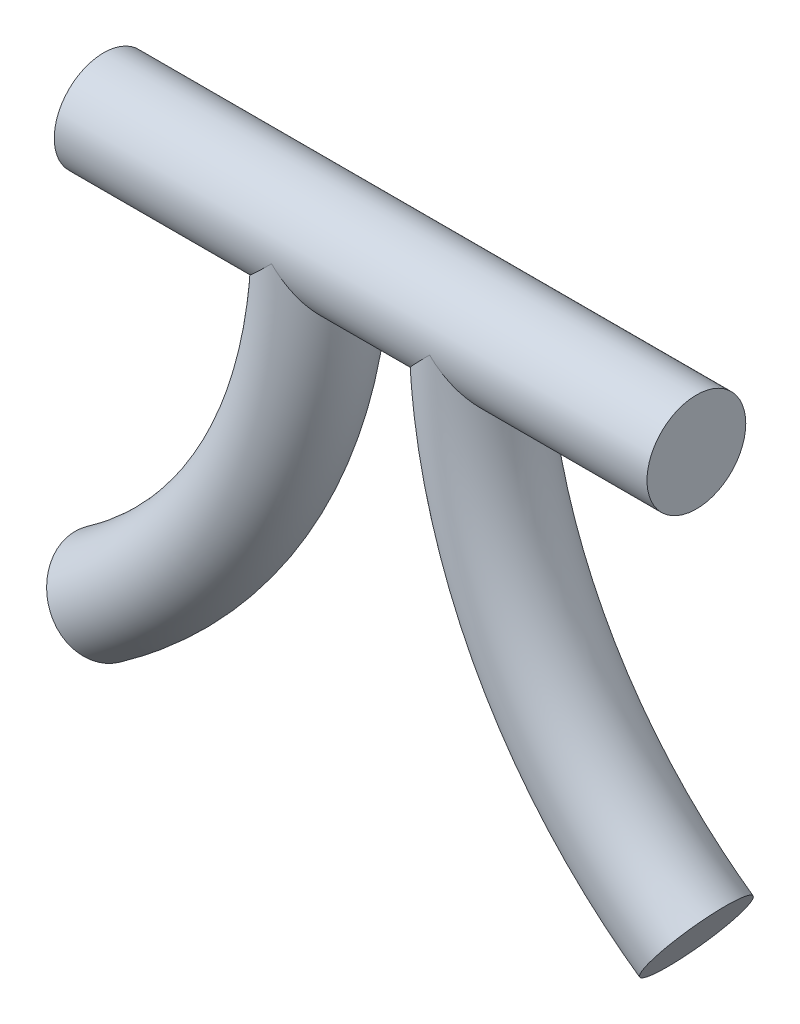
ISO-10303-21;
HEADER;
FILE_DESCRIPTION(('STEP AP214'),'2;1');
FILE_NAME('part.step','',(''),(''),'','','');
FILE_SCHEMA(('AUTOMOTIVE_DESIGN { 1 0 10303 214 1 1 1 1 }'));
ENDSEC;
DATA;
#1=APPLICATION_CONTEXT('core data for automotive mechanical design processes');
#2=APPLICATION_PROTOCOL_DEFINITION('international standard','automotive_design',2000,#1);
#3=PRODUCT_CONTEXT('',#1,'mechanical');
#4=PRODUCT('Part','Part','',(#3));
#5=PRODUCT_RELATED_PRODUCT_CATEGORY('part','',(#4));
#6=PRODUCT_DEFINITION_FORMATION('','',#4);
#7=PRODUCT_DEFINITION_CONTEXT('part definition',#1,'design');
#8=PRODUCT_DEFINITION('design','',#6,#7);
#9=PRODUCT_DEFINITION_SHAPE('','',#8);
#10=(LENGTH_UNIT() NAMED_UNIT(*) SI_UNIT(.MILLI.,.METRE.));
#11=(NAMED_UNIT(*) PLANE_ANGLE_UNIT() SI_UNIT($,.RADIAN.));
#12=(NAMED_UNIT(*) SI_UNIT($,.STERADIAN.) SOLID_ANGLE_UNIT());
#13=UNCERTAINTY_MEASURE_WITH_UNIT(LENGTH_MEASURE(1.E-05),#10,'distance_accuracy_value','');
#14=(GEOMETRIC_REPRESENTATION_CONTEXT(3) GLOBAL_UNCERTAINTY_ASSIGNED_CONTEXT((#13)) GLOBAL_UNIT_ASSIGNED_CONTEXT((#10,
#11,#12)) REPRESENTATION_CONTEXT('',''));
#15=CARTESIAN_POINT('',(0.,0.,0.));
#16=DIRECTION('',(0.,0.,1.));
#17=DIRECTION('',(1.,0.,0.));
#18=AXIS2_PLACEMENT_3D('',#15,#16,#17);
#19=CARTESIAN_POINT('',(-150.,0.,0.));
#20=DIRECTION('',(1.,0.,0.));
#21=DIRECTION('',(0.,0.,-1.));
#22=AXIS2_PLACEMENT_3D('',#19,#20,#21);
#23=CYLINDRICAL_SURFACE('',#22,25.);
#24=CARTESIAN_POINT('',(40.,0.,25.));
#25=CARTESIAN_POINT('',(39.99254646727,-0.00745353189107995,24.9999999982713));
#26=CARTESIAN_POINT('',(39.9850930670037,-0.014907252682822,24.9999966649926));
#27=CARTESIAN_POINT('',(39.0418702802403,-0.958211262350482,24.9991531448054));
#28=CARTESIAN_POINT('',(38.1082167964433,-1.8970099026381,24.9457909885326));
#29=CARTESIAN_POINT('',(36.2514504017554,-3.77391266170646,24.7315744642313));
#30=CARTESIAN_POINT('',(35.328346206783,-4.71201568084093,24.5706369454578));
#31=CARTESIAN_POINT('',(33.4979453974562,-6.58174248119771,24.1371758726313));
#32=CARTESIAN_POINT('',(32.5906825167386,-7.51335037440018,23.8644387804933));
#33=CARTESIAN_POINT('',(30.8019117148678,-9.35925339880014,23.2026966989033));
#34=CARTESIAN_POINT('',(29.920389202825,-10.2735582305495,22.8137590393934));
#35=CARTESIAN_POINT('',(28.4567491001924,-11.7988021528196,22.0516629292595));
#36=CARTESIAN_POINT('',(27.8655935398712,-12.4169190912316,21.7101294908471));
#37=CARTESIAN_POINT('',(26.9943244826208,-13.3307970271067,21.1522383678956));
#38=CARTESIAN_POINT('',(26.7064834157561,-13.6332019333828,20.9586796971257));
#39=CARTESIAN_POINT('',(26.1363638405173,-14.2330959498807,20.5560097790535));
#40=CARTESIAN_POINT('',(25.8540873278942,-14.5305832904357,20.3468930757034));
#41=CARTESIAN_POINT('',(25.0176771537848,-15.4133994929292,19.6967178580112));
#42=CARTESIAN_POINT('',(24.4727537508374,-15.9903512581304,19.2320651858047));
#43=CARTESIAN_POINT('',(23.4131797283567,-17.1153626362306,18.2380790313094));
#44=CARTESIAN_POINT('',(22.8985188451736,-17.6634320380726,17.7087676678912));
#45=CARTESIAN_POINT('',(22.020705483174,-18.6006587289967,16.714303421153));
#46=CARTESIAN_POINT('',(21.6500795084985,-18.9972112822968,16.2627041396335));
#47=CARTESIAN_POINT('',(20.9336319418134,-19.76521058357,15.3201179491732));
#48=CARTESIAN_POINT('',(20.5878089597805,-20.1366587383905,14.8291332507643));
#49=CARTESIAN_POINT('',(19.9249044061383,-20.8499027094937,13.8082860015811));
#50=CARTESIAN_POINT('',(19.6077999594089,-21.1917221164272,13.2784550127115));
#51=CARTESIAN_POINT('',(19.1567058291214,-21.67871773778,12.4553152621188));
#52=CARTESIAN_POINT('',(19.0104395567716,-21.8367556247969,12.1762133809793));
#53=CARTESIAN_POINT('',(18.7265569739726,-22.1437107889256,11.6086257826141));
#54=CARTESIAN_POINT('',(18.5889429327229,-22.2926256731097,11.3201376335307));
#55=CARTESIAN_POINT('',(18.2389872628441,-22.6715792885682,10.5490799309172));
#56=CARTESIAN_POINT('',(18.0343111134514,-22.8934869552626,10.0589544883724));
#57=CARTESIAN_POINT('',(17.6521091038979,-23.308259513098,9.05644828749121));
#58=CARTESIAN_POINT('',(17.4745777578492,-23.5011302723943,8.54407205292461));
#59=CARTESIAN_POINT('',(17.1490900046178,-23.8550207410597,7.4994612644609));
#60=CARTESIAN_POINT('',(17.001123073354,-24.0160517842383,6.96723385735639));
#61=CARTESIAN_POINT('',(16.7369650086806,-24.3037106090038,5.88580322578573));
#62=CARTESIAN_POINT('',(16.6207742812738,-24.4303379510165,5.33659978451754));
#63=CARTESIAN_POINT('',(16.4215635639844,-24.647537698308,4.22175425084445));
#64=CARTESIAN_POINT('',(16.338739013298,-24.737897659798,3.6560355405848));
#65=CARTESIAN_POINT('',(16.2087561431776,-24.8797420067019,2.51566065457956));
#66=CARTESIAN_POINT('',(16.161597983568,-24.9312262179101,1.94100443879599));
#67=CARTESIAN_POINT('',(16.1038695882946,-24.9942538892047,0.787811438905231));
#68=CARTESIAN_POINT('',(16.0932901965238,-25.0058073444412,0.209275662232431));
#69=CARTESIAN_POINT('',(16.1089072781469,-24.9887547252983,-0.946678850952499));
#70=CARTESIAN_POINT('',(16.1351011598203,-24.9601514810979,-1.52409766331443));
#71=CARTESIAN_POINT('',(16.2195563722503,-24.8679589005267,-2.6186471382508));
#72=CARTESIAN_POINT('',(16.2745663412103,-24.8079170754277,-3.13633553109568));
#73=CARTESIAN_POINT('',(16.4134534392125,-24.6563934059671,-4.16311572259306));
#74=CARTESIAN_POINT('',(16.4973283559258,-24.5649139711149,-4.6722081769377));
#75=CARTESIAN_POINT('',(16.6927035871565,-24.3519513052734,-5.67865128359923));
#76=CARTESIAN_POINT('',(16.8042042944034,-24.2304676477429,-6.17600176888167));
#77=CARTESIAN_POINT('',(17.0532958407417,-23.959272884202,-7.15624888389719));
#78=CARTESIAN_POINT('',(17.1908880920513,-23.8095602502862,-7.63914472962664));
#79=CARTESIAN_POINT('',(17.4964862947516,-23.4773288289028,-8.6074097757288));
#80=CARTESIAN_POINT('',(17.66549701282,-23.2937283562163,-9.09208955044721));
#81=CARTESIAN_POINT('',(18.0278044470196,-22.9005505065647,-10.0413523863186));
#82=CARTESIAN_POINT('',(18.2211010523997,-22.6909732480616,-10.5059355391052));
#83=CARTESIAN_POINT('',(18.6299503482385,-22.2481982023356,-11.4137102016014));
#84=CARTESIAN_POINT('',(18.8455097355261,-22.0149933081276,-11.8568952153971));
#85=CARTESIAN_POINT('',(19.2968069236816,-21.527368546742,-12.7207923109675));
#86=CARTESIAN_POINT('',(19.5325488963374,-21.2729442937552,-13.1414997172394));
#87=CARTESIAN_POINT('',(20.140121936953,-20.6181153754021,-14.1567405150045));
#88=CARTESIAN_POINT('',(20.5228546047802,-20.2063751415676,-14.7375088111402));
#89=CARTESIAN_POINT('',(21.3224857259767,-19.3480711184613,-15.8475493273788));
#90=CARTESIAN_POINT('',(21.7393968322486,-18.9014944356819,-16.376802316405));
#91=CARTESIAN_POINT('',(22.6030164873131,-17.9786532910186,-17.3849320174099));
#92=CARTESIAN_POINT('',(23.0497805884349,-17.5023335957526,-17.8637102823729));
#93=CARTESIAN_POINT('',(23.9678805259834,-16.5260001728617,-18.7705974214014));
#94=CARTESIAN_POINT('',(24.4392164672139,-16.0259863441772,-19.1987060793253));
#95=CARTESIAN_POINT('',(25.5716805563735,-14.827845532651,-20.1471073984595));
#96=CARTESIAN_POINT('',(26.2414101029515,-14.1217251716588,-20.6470921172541));
#97=CARTESIAN_POINT('',(27.61104786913,-12.6832148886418,-21.5606700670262));
#98=CARTESIAN_POINT('',(28.3109678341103,-11.9508147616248,-21.9742293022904));
#99=CARTESIAN_POINT('',(29.7346047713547,-10.4670711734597,-22.7184814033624));
#100=CARTESIAN_POINT('',(30.4583280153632,-9.71572273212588,-23.0491522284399));
#101=CARTESIAN_POINT('',(31.9239158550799,-8.20048083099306,-23.6307112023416));
#102=CARTESIAN_POINT('',(32.6657757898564,-7.43659061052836,-23.8816196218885));
#103=CARTESIAN_POINT('',(33.9514826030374,-6.11831743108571,-24.2464937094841));
#104=CARTESIAN_POINT('',(34.4920043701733,-5.56577087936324,-24.3791203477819));
#105=CARTESIAN_POINT('',(35.5786009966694,-4.45842459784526,-24.605729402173));
#106=CARTESIAN_POINT('',(36.1246755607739,-3.90362498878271,-24.6997138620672));
#107=CARTESIAN_POINT('',(37.7676032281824,-2.23968104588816,-24.9245871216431));
#108=CARTESIAN_POINT('',(38.8713242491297,-1.12877207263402,-24.9990005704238));
#109=CARTESIAN_POINT('',(39.9850930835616,-0.0149072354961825,-24.9999966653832));
#110=CARTESIAN_POINT('',(39.9925464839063,-0.00745351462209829,-24.999999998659));
#111=CARTESIAN_POINT('',(40.,0.,-25.));
#112=B_SPLINE_CURVE_WITH_KNOTS('',3,(#24,#25,#26,#27,#28,#29,#30,#31,#32,#33,#34,#35,#36,#37,
#38,#39,#40,#41,#42,#43,#44,#45,#46,#47,#48,#49,#50,#51,#52,#53,#54,#55,#56,#57,#58,#59,#60,#61,
#62,#63,#64,#65,#66,#67,#68,#69,#70,#71,#72,#73,#74,#75,#76,#77,#78,#79,#80,#81,#82,#83,#84,#85,
#86,#87,#88,#89,#90,#91,#92,#93,#94,#95,#96,#97,#98,#99,#100,#101,#102,#103,#104,#105,#106,#107,
#108,#109,#110,#111),.UNSPECIFIED.,.F.,.F.,(4,2,2,2,2,2,2,2,2,2,2,2,2,2,2,2,2,2,2,2,2,2,2,2,2,2,
2,2,2,2,2,2,2,2,2,2,2,2,2,2,2,2,2,4),(0.,0.0316227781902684,4.00191337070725,7.97527636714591,
11.9562641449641,15.9349496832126,18.6955331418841,20.0757798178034,21.4565128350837,
24.212252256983,26.967051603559,29.0835168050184,31.1998633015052,33.314508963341,
34.3717579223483,35.4292830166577,37.1543846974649,38.8791372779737,40.6032747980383,
42.3274343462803,44.0615510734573,45.795675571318,47.529365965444,49.2629341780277,
50.8332858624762,52.4035172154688,53.9737708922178,55.5441095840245,57.1779408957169,
58.8117647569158,60.4460815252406,62.0807369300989,64.5019454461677,66.9240543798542,
69.3508032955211,71.7775625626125,75.0551947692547,78.3341138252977,81.6139038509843,
84.8928596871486,87.2446402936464,89.5962964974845,94.290170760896,94.3217935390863),.UNSPECIFIED.);
#113=CARTESIAN_POINT('',(40.,0.,25.));
#114=VERTEX_POINT('',#113);
#115=CARTESIAN_POINT('',(40.,0.,-25.));
#116=VERTEX_POINT('',#115);
#117=EDGE_CURVE('E12',#114,#116,#112,.T.);
#118=ORIENTED_EDGE('',*,*,#117,.F.);
#119=CARTESIAN_POINT('',(40.,0.,-25.));
#120=CARTESIAN_POINT('',(40.007453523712,-0.00745352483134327,-24.9999999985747));
#121=CARTESIAN_POINT('',(40.0149072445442,-0.0149069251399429,-24.9999966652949));
#122=CARTESIAN_POINT('',(41.0057981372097,-1.00571245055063,-24.9991106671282));
#123=CARTESIAN_POINT('',(41.9926327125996,-1.98686340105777,-24.9402383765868));
#124=CARTESIAN_POINT('',(43.4718415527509,-3.44913078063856,-24.7657994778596));
#125=CARTESIAN_POINT('',(43.9649991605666,-3.93523257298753,-24.693236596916));
#126=CARTESIAN_POINT('',(44.9501303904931,-4.90347434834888,-24.5193355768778));
#127=CARTESIAN_POINT('',(45.4421040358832,-5.38561440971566,-24.4179980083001));
#128=CARTESIAN_POINT('',(46.9173908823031,-6.82723107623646,-24.0700683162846));
#129=CARTESIAN_POINT('',(47.8978269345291,-7.77968698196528,-23.7798215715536));
#130=CARTESIAN_POINT('',(49.3554905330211,-9.18762824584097,-23.2559244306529));
#131=CARTESIAN_POINT('',(49.8391556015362,-9.65342981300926,-23.0665658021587));
#132=CARTESIAN_POINT('',(50.801177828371,-10.577265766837,-22.6578145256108));
#133=CARTESIAN_POINT('',(51.2795353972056,-11.0353007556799,-22.4384242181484));
#134=CARTESIAN_POINT('',(52.4350898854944,-12.1386116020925,-21.8675417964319));
#135=CARTESIAN_POINT('',(53.1088535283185,-12.7792379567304,-21.4999409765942));
#136=CARTESIAN_POINT('',(54.4384025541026,-14.0383533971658,-20.6997840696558));
#137=CARTESIAN_POINT('',(55.0941876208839,-14.6568420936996,-20.2672268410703));
#138=CARTESIAN_POINT('',(56.3809417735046,-15.8657067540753,-19.3354752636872));
#139=CARTESIAN_POINT('',(57.0119590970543,-16.456137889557,-18.8364197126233));
#140=CARTESIAN_POINT('',(58.2435774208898,-17.6042516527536,-17.7680863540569));
#141=CARTESIAN_POINT('',(58.8441892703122,-18.1619459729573,-17.1988338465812));
#142=CARTESIAN_POINT('',(59.8334137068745,-19.0772651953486,-16.1673051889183));
#143=CARTESIAN_POINT('',(60.2319645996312,-19.4450752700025,-15.7235438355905));
#144=CARTESIAN_POINT('',(61.0060109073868,-20.1577361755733,-14.7988631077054));
#145=CARTESIAN_POINT('',(61.3815073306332,-20.5025880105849,-14.3179453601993));
#146=CARTESIAN_POINT('',(62.1045854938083,-21.1651968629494,-13.3189087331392));
#147=CARTESIAN_POINT('',(62.4521982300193,-21.482983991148,-12.8008324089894));
#148=CARTESIAN_POINT('',(63.1148777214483,-22.0875934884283,-11.7268005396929));
#149=CARTESIAN_POINT('',(63.4299412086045,-22.3744127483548,-11.1708412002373));
#150=CARTESIAN_POINT('',(63.9556324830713,-22.8521337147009,-10.1500263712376));
#151=CARTESIAN_POINT('',(64.1738971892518,-23.0501755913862,-9.69243427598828));
#152=CARTESIAN_POINT('',(64.5840035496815,-23.421828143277,-8.75622066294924));
#153=CARTESIAN_POINT('',(64.7758600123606,-23.5954525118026,-8.27761113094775));
#154=CARTESIAN_POINT('',(65.130090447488,-23.9156865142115,-7.30095326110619));
#155=CARTESIAN_POINT('',(65.2924736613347,-24.0623046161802,-6.80291107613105));
#156=CARTESIAN_POINT('',(65.5847519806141,-24.3259863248,-5.78967800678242));
#157=CARTESIAN_POINT('',(65.7146468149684,-24.4430496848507,-5.27448697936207));
#158=CARTESIAN_POINT('',(65.9400820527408,-24.6460916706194,-4.22584038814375));
#159=CARTESIAN_POINT('',(66.0353226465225,-24.7317990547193,-3.69226721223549));
#160=CARTESIAN_POINT('',(66.1875668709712,-24.8687537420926,-2.615280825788));
#161=CARTESIAN_POINT('',(66.2445705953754,-24.9200011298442,-2.07186763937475));
#162=CARTESIAN_POINT('',(66.318823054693,-24.9867479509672,-0.980409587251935));
#163=CARTESIAN_POINT('',(66.3360920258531,-25.0022655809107,-0.432367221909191));
#164=CARTESIAN_POINT('',(66.3304566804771,-24.9972010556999,0.663313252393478));
#165=CARTESIAN_POINT('',(66.3075562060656,-24.9766223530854,1.21095139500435));
#166=CARTESIAN_POINT('',(66.227685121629,-24.9048194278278,2.23093508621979));
#167=CARTESIAN_POINT('',(66.175439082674,-24.8578445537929,2.70396440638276));
#168=CARTESIAN_POINT('',(66.0419352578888,-24.7377469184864,3.64247605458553));
#169=CARTESIAN_POINT('',(65.9606811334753,-24.6646274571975,4.10795932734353));
#170=CARTESIAN_POINT('',(65.7706452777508,-24.4934969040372,5.02871453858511));
#171=CARTESIAN_POINT('',(65.6618560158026,-24.3954790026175,5.48398364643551));
#172=CARTESIAN_POINT('',(65.4186134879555,-24.1761305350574,6.38188113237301));
#173=CARTESIAN_POINT('',(65.2841562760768,-24.0547963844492,6.824507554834));
#174=CARTESIAN_POINT('',(64.9489156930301,-23.751968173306,7.82236359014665));
#175=CARTESIAN_POINT('',(64.7402270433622,-23.5632507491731,8.37276198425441));
#176=CARTESIAN_POINT('',(64.2880078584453,-23.1536689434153,9.44659307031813));
#177=CARTESIAN_POINT('',(64.0444687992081,-22.9327966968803,9.97001912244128));
#178=CARTESIAN_POINT('',(63.5266808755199,-22.4623777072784,10.9889441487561));
#179=CARTESIAN_POINT('',(63.2523906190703,-22.2127923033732,11.4844040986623));
#180=CARTESIAN_POINT('',(62.6775189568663,-21.688697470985,12.4458945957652));
#181=CARTESIAN_POINT('',(62.3769359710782,-21.4141865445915,12.9119233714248));
#182=CARTESIAN_POINT('',(61.6288871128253,-20.7296199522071,13.9942992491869));
#183=CARTESIAN_POINT('',(61.1705983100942,-20.3091216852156,14.5965975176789));
#184=CARTESIAN_POINT('',(60.2183886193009,-19.432703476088,15.7445846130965));
#185=CARTESIAN_POINT('',(59.7244540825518,-18.9767699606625,16.2902515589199));
#186=CARTESIAN_POINT('',(58.7071926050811,-18.0346926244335,17.3274764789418));
#187=CARTESIAN_POINT('',(58.1838187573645,-17.5485004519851,17.8189441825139));
#188=CARTESIAN_POINT('',(57.1141594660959,-16.5514515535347,18.7487091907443));
#189=CARTESIAN_POINT('',(56.5678742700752,-16.0405950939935,19.1870070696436));
#190=CARTESIAN_POINT('',(55.2280298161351,-14.7832630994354,20.1825872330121));
#191=CARTESIAN_POINT('',(54.4253019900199,-14.0264087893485,20.7145168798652));
#192=CARTESIAN_POINT('',(52.7933035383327,-12.4798385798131,21.681459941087));
#193=CARTESIAN_POINT('',(51.9640208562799,-11.6901077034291,22.1164285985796));
#194=CARTESIAN_POINT('',(50.287242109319,-10.0850795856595,22.8929173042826));
#195=CARTESIAN_POINT('',(49.4397499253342,-9.26978777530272,23.2344570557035));
#196=CARTESIAN_POINT('',(47.7330405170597,-7.61944042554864,23.8267155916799));
#197=CARTESIAN_POINT('',(46.8738278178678,-6.78439242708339,24.0774684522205));
#198=CARTESIAN_POINT('',(45.5138674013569,-5.45587739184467,24.4025338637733));
#199=CARTESIAN_POINT('',(45.0152309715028,-4.96733977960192,24.5066133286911));
#200=CARTESIAN_POINT('',(44.0167038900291,-3.98615676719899,24.6852040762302));
#201=CARTESIAN_POINT('',(43.5168131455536,-3.49351105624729,24.7597131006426));
#202=CARTESIAN_POINT('',(42.0181347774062,-2.0122169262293,24.9387076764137));
#203=CARTESIAN_POINT('',(41.0184981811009,-1.01841139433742,24.999099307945));
#204=CARTESIAN_POINT('',(40.0149072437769,-0.0149069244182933,24.999996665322));
#205=CARTESIAN_POINT('',(40.0074535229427,-0.00745352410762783,24.9999999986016));
#206=CARTESIAN_POINT('',(40.,0.,25.));
#207=B_SPLINE_CURVE_WITH_KNOTS('',3,(#119,#120,#121,#122,#123,#124,#125,#126,#127,#128,#129,
#130,#131,#132,#133,#134,#135,#136,#137,#138,#139,#140,#141,#142,#143,#144,#145,#146,#147,#148,
#149,#150,#151,#152,#153,#154,#155,#156,#157,#158,#159,#160,#161,#162,#163,#164,#165,#166,#167,
#168,#169,#170,#171,#172,#173,#174,#175,#176,#177,#178,#179,#180,#181,#182,#183,#184,#185,#186,
#187,#188,#189,#190,#191,#192,#193,#194,#195,#196,#197,#198,#199,#200,#201,#202,#203,#204,#205,
#206),.UNSPECIFIED.,.F.,.F.,(4,2,2,2,2,2,2,2,2,2,2,2,2,2,2,2,2,2,2,2,2,2,2,2,2,2,2,2,2,2,2,2,2,
2,2,2,2,2,2,2,2,2,2,4),(0.,0.0316227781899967,4.2037933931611,6.29209972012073,8.38036464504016,
12.566360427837,14.6588521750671,16.7511809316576,19.7479697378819,22.7448112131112,
25.7354927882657,28.7250996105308,30.8258423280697,32.9264931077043,35.0247754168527,
37.1232681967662,38.7547048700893,40.3852229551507,42.0152289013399,43.6452484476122,
45.2890523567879,46.9328522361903,48.5758147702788,50.2186201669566,51.6516240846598,
53.0844471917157,54.517662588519,55.9510984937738,57.8028150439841,59.654985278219,
61.5096792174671,63.3644846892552,65.9579623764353,68.5524384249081,71.1511723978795,
73.7498783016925,77.4189910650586,81.0897939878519,84.7598221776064,88.4284714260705,
90.5452431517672,92.6621764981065,96.8882258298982,96.9198486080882),.UNSPECIFIED.);
#208=EDGE_CURVE('E71',#116,#114,#207,.T.);
#209=ORIENTED_EDGE('',*,*,#208,.F.);
#210=EDGE_LOOP('',(#118,#209));
#211=FACE_BOUND('',#210,.T.);
#212=CARTESIAN_POINT('',(-40.,0.,25.));
#213=CARTESIAN_POINT('',(-40.0074535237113,-0.00745352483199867,24.9999999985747));
#214=CARTESIAN_POINT('',(-40.0149072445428,-0.0149069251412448,24.9999966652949));
#215=CARTESIAN_POINT('',(-41.0057981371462,-1.00571245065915,24.999110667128));
#216=CARTESIAN_POINT('',(-41.992632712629,-1.9868634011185,24.940238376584));
#217=CARTESIAN_POINT('',(-43.4718415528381,-3.44913078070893,24.7657994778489));
#218=CARTESIAN_POINT('',(-43.9649991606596,-3.93523257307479,24.6932365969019));
#219=CARTESIAN_POINT('',(-44.9501303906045,-4.90347434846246,24.5193355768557));
#220=CARTESIAN_POINT('',(-45.4421040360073,-5.38561440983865,24.4179980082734));
#221=CARTESIAN_POINT('',(-46.9173908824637,-6.82723107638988,24.0700683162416));
#222=CARTESIAN_POINT('',(-47.8978269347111,-7.77968698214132,23.779821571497));
#223=CARTESIAN_POINT('',(-49.3554905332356,-9.18762824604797,23.2559244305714));
#224=CARTESIAN_POINT('',(-49.8391556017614,-9.65342981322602,23.0665658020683));
#225=CARTESIAN_POINT('',(-50.8011778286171,-10.5772657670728,22.6578145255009));
#226=CARTESIAN_POINT('',(-51.2795353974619,-11.0353007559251,22.4384242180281));
#227=CARTESIAN_POINT('',(-52.4350898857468,-12.1386116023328,21.8675417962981));
#228=CARTESIAN_POINT('',(-53.108853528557,-12.7792379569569,21.4999409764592));
#229=CARTESIAN_POINT('',(-54.4384025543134,-14.0383533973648,20.6997840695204));
#230=CARTESIAN_POINT('',(-55.0941876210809,-14.6568420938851,20.2672268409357));
#231=CARTESIAN_POINT('',(-56.3809417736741,-15.8657067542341,19.3354752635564));
#232=CARTESIAN_POINT('',(-57.0119590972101,-16.4561378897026,18.8364197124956));
#233=CARTESIAN_POINT('',(-58.2435774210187,-17.6042516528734,17.7680863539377));
#234=CARTESIAN_POINT('',(-58.8441892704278,-18.1619459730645,17.1988338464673));
#235=CARTESIAN_POINT('',(-59.8334137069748,-19.0772651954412,16.167305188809));
#236=CARTESIAN_POINT('',(-60.2319645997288,-19.4450752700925,15.7235438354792));
#237=CARTESIAN_POINT('',(-61.0060109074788,-20.1577361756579,14.7988631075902));
#238=CARTESIAN_POINT('',(-61.3815073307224,-20.5025880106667,14.3179453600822));
#239=CARTESIAN_POINT('',(-62.1045854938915,-21.1651968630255,13.3189087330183));
#240=CARTESIAN_POINT('',(-62.4521982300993,-21.4829839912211,12.8008324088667));
#241=CARTESIAN_POINT('',(-63.1148777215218,-22.0875934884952,11.7268005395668));
#242=CARTESIAN_POINT('',(-63.4299412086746,-22.3744127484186,11.1708412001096));
#243=CARTESIAN_POINT('',(-63.9556324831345,-22.8521337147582,10.1500263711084));
#244=CARTESIAN_POINT('',(-64.1738971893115,-23.0501755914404,9.69243427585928));
#245=CARTESIAN_POINT('',(-64.5840035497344,-23.4218281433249,8.75622066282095));
#246=CARTESIAN_POINT('',(-64.7758600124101,-23.5954525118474,8.27761113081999));
#247=CARTESIAN_POINT('',(-65.1300904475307,-23.9156865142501,7.30095326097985));
#248=CARTESIAN_POINT('',(-65.292473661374,-24.0623046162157,6.80291107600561));
#249=CARTESIAN_POINT('',(-65.5847519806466,-24.3259863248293,5.78967800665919));
#250=CARTESIAN_POINT('',(-65.7146468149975,-24.4430496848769,5.27448697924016));
#251=CARTESIAN_POINT('',(-65.9400820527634,-24.6460916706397,4.225840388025));
#252=CARTESIAN_POINT('',(-66.0353226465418,-24.7317990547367,3.6922672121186));
#253=CARTESIAN_POINT('',(-66.1875668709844,-24.8687537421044,2.61528082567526));
#254=CARTESIAN_POINT('',(-66.2445705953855,-24.9200011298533,2.0718676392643));
#255=CARTESIAN_POINT('',(-66.3188230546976,-24.9867479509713,0.980409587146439));
#256=CARTESIAN_POINT('',(-66.3360920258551,-25.0022655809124,0.432367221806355));
#257=CARTESIAN_POINT('',(-66.3304566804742,-24.9972010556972,-0.663313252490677));
#258=CARTESIAN_POINT('',(-66.3075562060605,-24.9766223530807,-1.21095139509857));
#259=CARTESIAN_POINT('',(-66.22768512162,-24.9048194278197,-2.23093508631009));
#260=CARTESIAN_POINT('',(-66.1754390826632,-24.8578445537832,-2.7039644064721));
#261=CARTESIAN_POINT('',(-66.0419352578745,-24.7377469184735,-3.64247605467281));
#262=CARTESIAN_POINT('',(-65.9606811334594,-24.6646274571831,-4.10795932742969));
#263=CARTESIAN_POINT('',(-65.7706452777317,-24.4934969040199,-5.02871453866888));
#264=CARTESIAN_POINT('',(-65.661856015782,-24.3954790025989,-5.48398364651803));
#265=CARTESIAN_POINT('',(-65.4186134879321,-24.1761305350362,-6.38188113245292));
#266=CARTESIAN_POINT('',(-65.2841562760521,-24.0547963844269,-6.82450755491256));
#267=CARTESIAN_POINT('',(-64.9489156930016,-23.7519681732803,-7.82236359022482));
#268=CARTESIAN_POINT('',(-64.7402270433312,-23.5632507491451,-8.37276198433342));
#269=CARTESIAN_POINT('',(-64.2880078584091,-23.1536689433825,-9.44659307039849));
#270=CARTESIAN_POINT('',(-64.0444687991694,-22.9327966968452,-9.97001912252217));
#271=CARTESIAN_POINT('',(-63.526680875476,-22.4623777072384,-10.9889441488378));
#272=CARTESIAN_POINT('',(-63.2523906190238,-22.2127923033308,-11.4844040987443));
#273=CARTESIAN_POINT('',(-62.6775189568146,-21.6886974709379,-12.4458945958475));
#274=CARTESIAN_POINT('',(-62.376935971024,-21.4141865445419,-12.9119233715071));
#275=CARTESIAN_POINT('',(-61.6288871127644,-20.7296199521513,-13.9942992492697));
#276=CARTESIAN_POINT('',(-61.1705983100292,-20.309121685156,-14.596597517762));
#277=CARTESIAN_POINT('',(-60.2183886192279,-19.4327034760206,-15.7445846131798));
#278=CARTESIAN_POINT('',(-59.7244540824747,-18.9767699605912,-16.290251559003));
#279=CARTESIAN_POINT('',(-58.707192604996,-18.0346926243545,-17.3274764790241));
#280=CARTESIAN_POINT('',(-58.1838187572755,-17.5485004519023,-17.8189441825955));
#281=CARTESIAN_POINT('',(-57.1141594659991,-16.5514515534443,-18.7487091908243));
#282=CARTESIAN_POINT('',(-56.5678742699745,-16.0405950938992,-19.1870070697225));
#283=CARTESIAN_POINT('',(-55.2280298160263,-14.7832630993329,-20.1825872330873));
#284=CARTESIAN_POINT('',(-54.4253019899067,-14.0264087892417,-20.7145168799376));
#285=CARTESIAN_POINT('',(-52.7933035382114,-12.4798385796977,-21.6814599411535));
#286=CARTESIAN_POINT('',(-51.9640208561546,-11.6901077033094,-22.1164285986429));
#287=CARTESIAN_POINT('',(-50.2872421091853,-10.0850795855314,-22.8929173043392));
#288=CARTESIAN_POINT('',(-49.4397499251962,-9.26978777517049,-23.2344570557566));
#289=CARTESIAN_POINT('',(-47.7330405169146,-7.61944042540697,-23.8267155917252));
#290=CARTESIAN_POINT('',(-46.87382781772,-6.7843924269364,-24.0774684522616));
#291=CARTESIAN_POINT('',(-45.5138674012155,-5.45587739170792,-24.4025338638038));
#292=CARTESIAN_POINT('',(-45.0152309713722,-4.96733977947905,-24.5066133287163));
#293=CARTESIAN_POINT('',(-44.016703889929,-3.98615676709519,-24.6852040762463));
#294=CARTESIAN_POINT('',(-43.5168131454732,-3.49351105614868,-24.7597131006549));
#295=CARTESIAN_POINT('',(-42.0181347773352,-2.01221692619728,-24.9387076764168));
#296=CARTESIAN_POINT('',(-41.0184981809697,-1.01841139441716,-24.9990993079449));
#297=CARTESIAN_POINT('',(-40.0149072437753,-0.0149069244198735,-24.999996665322));
#298=CARTESIAN_POINT('',(-40.0074535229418,-0.00745352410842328,-24.9999999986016));
#299=CARTESIAN_POINT('',(-40.,0.,-25.));
#300=B_SPLINE_CURVE_WITH_KNOTS('',3,(#212,#213,#214,#215,#216,#217,#218,#219,#220,#221,#222,
#223,#224,#225,#226,#227,#228,#229,#230,#231,#232,#233,#234,#235,#236,#237,#238,#239,#240,#241,
#242,#243,#244,#245,#246,#247,#248,#249,#250,#251,#252,#253,#254,#255,#256,#257,#258,#259,#260,
#261,#262,#263,#264,#265,#266,#267,#268,#269,#270,#271,#272,#273,#274,#275,#276,#277,#278,#279,
#280,#281,#282,#283,#284,#285,#286,#287,#288,#289,#290,#291,#292,#293,#294,#295,#296,#297,#298,
#299),.UNSPECIFIED.,.F.,.F.,(4,2,2,2,2,2,2,2,2,2,2,2,2,2,2,2,2,2,2,2,2,2,2,2,2,2,2,2,2,2,2,2,2,
2,2,2,2,2,2,2,2,2,2,4),(0.,0.0316227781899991,4.20379339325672,6.29209972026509,
8.38036464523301,12.5663604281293,14.6588521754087,16.7511809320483,19.7479697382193,
22.7448112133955,25.735492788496,28.7250996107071,30.8258423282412,32.926493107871,
35.0247754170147,37.1232681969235,38.7547048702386,40.3852229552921,42.0152289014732,
43.6452484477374,45.2890523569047,46.9328522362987,48.5758147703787,50.2186201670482,
51.6516240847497,53.0844471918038,54.5176625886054,55.9510984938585,57.8028150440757,
59.6549852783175,61.5096792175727,63.3644846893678,65.9579623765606,68.5524384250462,
71.1511723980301,73.7498783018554,77.4189910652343,81.0897939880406,84.7598221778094,
88.4284714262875,90.5452431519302,92.6621764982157,96.8882258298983,96.9198486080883),.UNSPECIFIED.);
#301=CARTESIAN_POINT('',(-40.,0.,25.));
#302=VERTEX_POINT('',#301);
#303=CARTESIAN_POINT('',(-40.,0.,-25.));
#304=VERTEX_POINT('',#303);
#305=EDGE_CURVE('E90',#302,#304,#300,.T.);
#306=ORIENTED_EDGE('',*,*,#305,.F.);
#307=CARTESIAN_POINT('',(-40.,0.,-25.));
#308=CARTESIAN_POINT('',(-39.9925464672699,-0.00745353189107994,-24.9999999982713));
#309=CARTESIAN_POINT('',(-39.9850930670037,-0.014907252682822,-24.9999966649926));
#310=CARTESIAN_POINT('',(-39.0418702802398,-0.958211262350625,-24.9991531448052));
#311=CARTESIAN_POINT('',(-38.1082167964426,-1.89700990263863,-24.9457909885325));
#312=CARTESIAN_POINT('',(-36.2514504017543,-3.77391266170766,-24.7315744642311));
#313=CARTESIAN_POINT('',(-35.3283462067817,-4.7120156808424,-24.5706369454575));
#314=CARTESIAN_POINT('',(-33.4979453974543,-6.58174248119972,-24.1371758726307));
#315=CARTESIAN_POINT('',(-32.5906825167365,-7.51335037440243,-23.8644387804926));
#316=CARTESIAN_POINT('',(-30.8019117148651,-9.35925339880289,-23.2026966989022));
#317=CARTESIAN_POINT('',(-29.9203892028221,-10.2735582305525,-22.8137590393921));
#318=CARTESIAN_POINT('',(-28.4567491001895,-11.7988021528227,-22.0516629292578));
#319=CARTESIAN_POINT('',(-27.8655935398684,-12.4169190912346,-21.7101294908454));
#320=CARTESIAN_POINT('',(-26.9943244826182,-13.3307970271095,-21.1522383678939));
#321=CARTESIAN_POINT('',(-26.7064834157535,-13.6332019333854,-20.958679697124));
#322=CARTESIAN_POINT('',(-26.1363638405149,-14.2330959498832,-20.5560097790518));
#323=CARTESIAN_POINT('',(-25.8540873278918,-14.5305832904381,-20.3468930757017));
#324=CARTESIAN_POINT('',(-25.0176771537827,-15.4133994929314,-19.6967178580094));
#325=CARTESIAN_POINT('',(-24.4727537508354,-15.9903512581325,-19.2320651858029));
#326=CARTESIAN_POINT('',(-23.413179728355,-17.1153626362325,-18.2380790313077));
#327=CARTESIAN_POINT('',(-22.898518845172,-17.6634320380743,-17.7087676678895));
#328=CARTESIAN_POINT('',(-22.0207054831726,-18.6006587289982,-16.7143034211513));
#329=CARTESIAN_POINT('',(-21.6500795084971,-18.9972112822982,-16.2627041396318));
#330=CARTESIAN_POINT('',(-20.9336319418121,-19.7652105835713,-15.3201179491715));
#331=CARTESIAN_POINT('',(-20.5878089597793,-20.1366587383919,-14.8291332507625));
#332=CARTESIAN_POINT('',(-19.9249044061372,-20.8499027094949,-13.8082860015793));
#333=CARTESIAN_POINT('',(-19.6077999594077,-21.1917221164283,-13.2784550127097));
#334=CARTESIAN_POINT('',(-19.1567058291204,-21.678717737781,-12.455315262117));
#335=CARTESIAN_POINT('',(-19.0104395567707,-21.836755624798,-12.1762133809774));
#336=CARTESIAN_POINT('',(-18.7265569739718,-22.1437107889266,-11.6086257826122));
#337=CARTESIAN_POINT('',(-18.588942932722,-22.2926256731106,-11.3201376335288));
#338=CARTESIAN_POINT('',(-18.2389872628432,-22.6715792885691,-10.5490799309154));
#339=CARTESIAN_POINT('',(-18.0343111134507,-22.8934869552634,-10.0589544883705));
#340=CARTESIAN_POINT('',(-17.6521091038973,-23.3082595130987,-9.05644828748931));
#341=CARTESIAN_POINT('',(-17.4745777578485,-23.501130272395,-8.54407205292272));
#342=CARTESIAN_POINT('',(-17.1490900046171,-23.8550207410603,-7.49946126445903));
#343=CARTESIAN_POINT('',(-17.0011230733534,-24.0160517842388,-6.96723385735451));
#344=CARTESIAN_POINT('',(-16.7369650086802,-24.3037106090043,-5.88580322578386));
#345=CARTESIAN_POINT('',(-16.6207742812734,-24.4303379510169,-5.33659978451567));
#346=CARTESIAN_POINT('',(-16.4215635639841,-24.6475376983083,-4.2217542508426));
#347=CARTESIAN_POINT('',(-16.3387390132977,-24.7378976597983,-3.65603554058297));
#348=CARTESIAN_POINT('',(-16.2087561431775,-24.8797420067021,-2.51566065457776));
#349=CARTESIAN_POINT('',(-16.1615979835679,-24.9312262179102,-1.94100443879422));
#350=CARTESIAN_POINT('',(-16.1038695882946,-24.9942538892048,-0.787811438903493));
#351=CARTESIAN_POINT('',(-16.0932901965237,-25.0058073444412,-0.20927566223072));
#352=CARTESIAN_POINT('',(-16.1089072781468,-24.9887547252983,0.946678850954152));
#353=CARTESIAN_POINT('',(-16.1351011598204,-24.9601514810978,1.52409766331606));
#354=CARTESIAN_POINT('',(-16.2195563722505,-24.8679589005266,2.61864713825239));
#355=CARTESIAN_POINT('',(-16.2745663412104,-24.8079170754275,3.13633553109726));
#356=CARTESIAN_POINT('',(-16.4134534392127,-24.6563934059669,4.1631157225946));
#357=CARTESIAN_POINT('',(-16.4973283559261,-24.5649139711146,4.67220817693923));
#358=CARTESIAN_POINT('',(-16.6927035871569,-24.3519513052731,5.67865128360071));
#359=CARTESIAN_POINT('',(-16.8042042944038,-24.2304676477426,6.17600176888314));
#360=CARTESIAN_POINT('',(-17.053295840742,-23.9592728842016,7.15624888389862));
#361=CARTESIAN_POINT('',(-17.1908880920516,-23.8095602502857,7.63914472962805));
#362=CARTESIAN_POINT('',(-17.496486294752,-23.4773288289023,8.60740977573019));
#363=CARTESIAN_POINT('',(-17.6654970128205,-23.2937283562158,9.09208955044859));
#364=CARTESIAN_POINT('',(-18.0278044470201,-22.9005505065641,10.0413523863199));
#365=CARTESIAN_POINT('',(-18.2211010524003,-22.690973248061,10.5059355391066));
#366=CARTESIAN_POINT('',(-18.6299503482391,-22.2481982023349,11.4137102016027));
#367=CARTESIAN_POINT('',(-18.8455097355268,-22.0149933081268,11.8568952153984));
#368=CARTESIAN_POINT('',(-19.2968069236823,-21.5273685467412,12.7207923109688));
#369=CARTESIAN_POINT('',(-19.5325488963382,-21.2729442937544,13.1414997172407));
#370=CARTESIAN_POINT('',(-20.1401219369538,-20.6181153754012,14.1567405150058));
#371=CARTESIAN_POINT('',(-20.5228546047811,-20.2063751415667,14.7375088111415));
#372=CARTESIAN_POINT('',(-21.3224857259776,-19.3480711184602,15.8475493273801));
#373=CARTESIAN_POINT('',(-21.7393968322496,-18.9014944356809,16.3768023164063));
#374=CARTESIAN_POINT('',(-22.6030164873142,-17.9786532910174,17.3849320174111));
#375=CARTESIAN_POINT('',(-23.049780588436,-17.5023335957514,17.8637102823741));
#376=CARTESIAN_POINT('',(-23.9678805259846,-16.5260001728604,18.7705974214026));
#377=CARTESIAN_POINT('',(-24.4392164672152,-16.0259863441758,19.1987060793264));
#378=CARTESIAN_POINT('',(-25.5716805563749,-14.8278455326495,20.1471073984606));
#379=CARTESIAN_POINT('',(-26.2414101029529,-14.1217251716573,20.6470921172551));
#380=CARTESIAN_POINT('',(-27.6110478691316,-12.6832148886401,21.5606700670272));
#381=CARTESIAN_POINT('',(-28.310967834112,-11.950814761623,21.9742293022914));
#382=CARTESIAN_POINT('',(-29.7346047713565,-10.4670711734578,22.7184814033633));
#383=CARTESIAN_POINT('',(-30.4583280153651,-9.71572273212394,23.0491522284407));
#384=CARTESIAN_POINT('',(-31.9239158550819,-8.20048083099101,23.6307112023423));
#385=CARTESIAN_POINT('',(-32.6657757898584,-7.43659061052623,23.8816196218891));
#386=CARTESIAN_POINT('',(-33.9514826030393,-6.11831743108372,24.2464937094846));
#387=CARTESIAN_POINT('',(-34.4920043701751,-5.56577087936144,24.3791203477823));
#388=CARTESIAN_POINT('',(-35.5786009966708,-4.4584245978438,24.6057294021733));
#389=CARTESIAN_POINT('',(-36.1246755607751,-3.90362498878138,24.6997138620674));
#390=CARTESIAN_POINT('',(-37.7676032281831,-2.23968104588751,24.9245871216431));
#391=CARTESIAN_POINT('',(-38.8713242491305,-1.12877207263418,24.9990005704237));
#392=CARTESIAN_POINT('',(-39.9850930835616,-0.0149072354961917,24.9999966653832));
#393=CARTESIAN_POINT('',(-39.9925464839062,-0.00745351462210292,24.999999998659));
#394=CARTESIAN_POINT('',(-40.,0.,25.));
#395=B_SPLINE_CURVE_WITH_KNOTS('',3,(#307,#308,#309,#310,#311,#312,#313,#314,#315,#316,#317,
#318,#319,#320,#321,#322,#323,#324,#325,#326,#327,#328,#329,#330,#331,#332,#333,#334,#335,#336,
#337,#338,#339,#340,#341,#342,#343,#344,#345,#346,#347,#348,#349,#350,#351,#352,#353,#354,#355,
#356,#357,#358,#359,#360,#361,#362,#363,#364,#365,#366,#367,#368,#369,#370,#371,#372,#373,#374,
#375,#376,#377,#378,#379,#380,#381,#382,#383,#384,#385,#386,#387,#388,#389,#390,#391,#392,#393,
#394),.UNSPECIFIED.,.F.,.F.,(4,2,2,2,2,2,2,2,2,2,2,2,2,2,2,2,2,2,2,2,2,2,2,2,2,2,2,2,2,2,2,2,2,
2,2,2,2,2,2,2,2,2,2,4),(0.,0.0316227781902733,4.00191337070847,7.97527636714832,
11.9562641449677,15.9349496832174,18.6955331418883,20.0757798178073,21.4565128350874,
24.2122522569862,26.9670516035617,29.083516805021,31.1998633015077,33.3145089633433,
34.3717579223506,35.4292830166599,37.154384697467,38.8791372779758,40.6032747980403,
42.3274343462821,44.0615510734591,45.7956755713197,47.5293659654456,49.2629341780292,
50.8332858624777,52.4035172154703,53.9737708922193,55.544109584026,57.1779408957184,
58.8117647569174,60.4460815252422,62.0807369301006,64.5019454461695,66.9240543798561,
69.3508032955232,71.7775625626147,75.0551947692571,78.3341138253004,81.6139038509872,
84.8928596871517,87.2446402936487,89.596296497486,94.290170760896,94.3217935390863),.UNSPECIFIED.);
#396=EDGE_CURVE('E82',#304,#302,#395,.T.);
#397=ORIENTED_EDGE('',*,*,#396,.F.);
#398=EDGE_LOOP('',(#306,#397));
#399=FACE_BOUND('',#398,.T.);
#400=CARTESIAN_POINT('',(-150.,0.,0.));
#401=DIRECTION('',(1.,0.,0.));
#402=DIRECTION('',(0.,0.,-1.));
#403=AXIS2_PLACEMENT_3D('',#400,#401,#402);
#404=CIRCLE('',#403,25.);
#405=CARTESIAN_POINT('',(-150.,0.,-25.));
#406=VERTEX_POINT('',#405);
#407=EDGE_CURVE('E126',#406,#406,#404,.T.);
#408=ORIENTED_EDGE('',*,*,#407,.T.);
#409=EDGE_LOOP('',(#408));
#410=FACE_BOUND('',#409,.T.);
#411=CARTESIAN_POINT('',(150.,0.,0.));
#412=DIRECTION('',(1.,0.,0.));
#413=DIRECTION('',(0.,0.,-1.));
#414=AXIS2_PLACEMENT_3D('',#411,#412,#413);
#415=CIRCLE('',#414,25.);
#416=CARTESIAN_POINT('',(150.,0.,-25.));
#417=VERTEX_POINT('',#416);
#418=EDGE_CURVE('E127',#417,#417,#415,.T.);
#419=ORIENTED_EDGE('',*,*,#418,.F.);
#420=EDGE_LOOP('',(#419));
#421=FACE_BOUND('',#420,.T.);
#422=ADVANCED_FACE('F57',(#211,#399,#410,#421),#23,.T.);
#423=CARTESIAN_POINT('',(-150.,0.,0.));
#424=DIRECTION('',(1.,0.,0.));
#425=DIRECTION('',(0.,0.,-1.));
#426=AXIS2_PLACEMENT_3D('',#423,#424,#425);
#427=PLANE('',#426);
#428=ORIENTED_EDGE('',*,*,#407,.F.);
#429=EDGE_LOOP('',(#428));
#430=FACE_BOUND('',#429,.T.);
#431=ADVANCED_FACE('F147',(#430),#427,.F.);
#432=CARTESIAN_POINT('',(150.,0.,0.));
#433=DIRECTION('',(1.,0.,0.));
#434=DIRECTION('',(0.,0.,-1.));
#435=AXIS2_PLACEMENT_3D('',#432,#433,#434);
#436=PLANE('',#435);
#437=ORIENTED_EDGE('',*,*,#418,.T.);
#438=EDGE_LOOP('',(#437));
#439=FACE_BOUND('',#438,.T.);
#440=ADVANCED_FACE('F117',(#439),#436,.T.);
#441=CARTESIAN_POINT('',(-150.,-212.367605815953,0.));
#442=DIRECTION('',(-0.816798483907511,-0.576923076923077,0.));
#443=DIRECTION('',(0.576923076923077,-0.816798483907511,0.));
#444=AXIS2_PLACEMENT_3D('',#441,#442,#443);
#445=PLANE('',#444);
#446=CARTESIAN_POINT('',(-150.,-212.367605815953,0.));
#447=DIRECTION('',(-0.816798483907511,-0.576923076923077,0.));
#448=DIRECTION('',(0.576923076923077,-0.816798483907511,0.));
#449=AXIS2_PLACEMENT_3D('',#446,#447,#448);
#450=CIRCLE('',#449,25.);
#451=CARTESIAN_POINT('',(-135.576923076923,-232.787567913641,0.));
#452=VERTEX_POINT('',#451);
#453=EDGE_CURVE('E131',#452,#452,#450,.T.);
#454=ORIENTED_EDGE('',*,*,#453,.T.);
#455=EDGE_LOOP('',(#454));
#456=FACE_BOUND('',#455,.T.);
#457=ADVANCED_FACE('F108',(#456),#445,.T.);
#458=CARTESIAN_POINT('',(-300.,0.,0.));
#459=DIRECTION('',(0.,0.,-1.));
#460=DIRECTION('',(-1.,0.,0.));
#461=AXIS2_PLACEMENT_3D('',#458,#459,#460);
#462=TOROIDAL_SURFACE('',#461,260.,25.);
#463=ORIENTED_EDGE('',*,*,#453,.F.);
#464=EDGE_LOOP('',(#463));
#465=FACE_BOUND('',#464,.T.);
#466=ORIENTED_EDGE('',*,*,#396,.T.);
#467=ORIENTED_EDGE('',*,*,#305,.T.);
#468=EDGE_LOOP('',(#466,#467));
#469=FACE_BOUND('',#468,.T.);
#470=ADVANCED_FACE('F111',(#465,#469),#462,.T.);
#471=CARTESIAN_POINT('',(150.,-212.367605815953,0.));
#472=DIRECTION('',(0.816798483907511,-0.576923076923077,0.));
#473=DIRECTION('',(-0.576923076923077,-0.816798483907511,0.));
#474=AXIS2_PLACEMENT_3D('',#471,#472,#473);
#475=PLANE('',#474);
#476=CARTESIAN_POINT('',(150.,-212.367605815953,0.));
#477=DIRECTION('',(-0.816798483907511,0.576923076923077,0.));
#478=DIRECTION('',(-0.576923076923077,-0.816798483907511,0.));
#479=AXIS2_PLACEMENT_3D('',#476,#477,#478);
#480=CIRCLE('',#479,25.);
#481=CARTESIAN_POINT('',(135.576923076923,-232.787567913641,0.));
#482=VERTEX_POINT('',#481);
#483=EDGE_CURVE('E138',#482,#482,#480,.F.);
#484=ORIENTED_EDGE('',*,*,#483,.T.);
#485=EDGE_LOOP('',(#484));
#486=FACE_BOUND('',#485,.T.);
#487=ADVANCED_FACE('F106',(#486),#475,.T.);
#488=CARTESIAN_POINT('',(300.,0.,0.));
#489=DIRECTION('',(0.,0.,1.));
#490=DIRECTION('',(1.,0.,0.));
#491=AXIS2_PLACEMENT_3D('',#488,#489,#490);
#492=TOROIDAL_SURFACE('',#491,260.,25.);
#493=ORIENTED_EDGE('',*,*,#483,.F.);
#494=EDGE_LOOP('',(#493));
#495=FACE_BOUND('',#494,.T.);
#496=ORIENTED_EDGE('',*,*,#208,.T.);
#497=ORIENTED_EDGE('',*,*,#117,.T.);
#498=EDGE_LOOP('',(#496,#497));
#499=FACE_BOUND('',#498,.T.);
#500=ADVANCED_FACE('F88',(#495,#499),#492,.T.);
#501=CLOSED_SHELL('',(#422,#431,#440,#457,#470,#487,#500));
#502=MANIFOLD_SOLID_BREP('B2',#501);
#503=ADVANCED_BREP_SHAPE_REPRESENTATION('',(#18,#502),#14);
#504=SHAPE_DEFINITION_REPRESENTATION(#9,#503);
ENDSEC;
END-ISO-10303-21;
